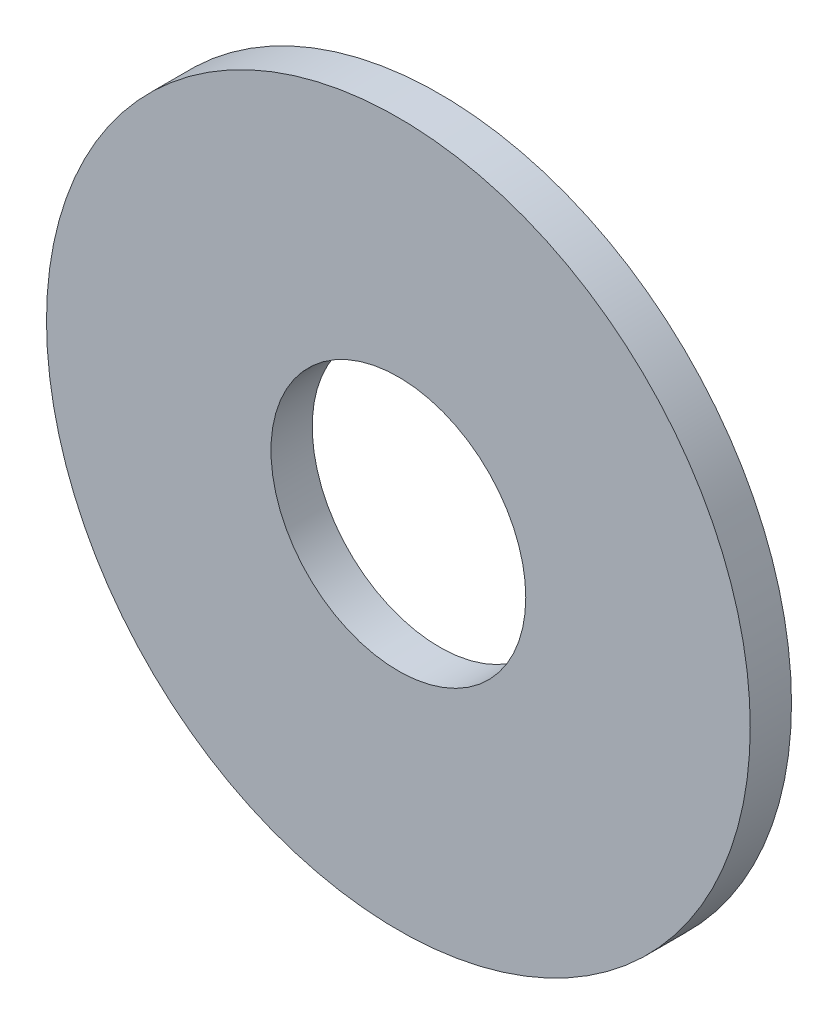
from build123d import *

# Parameters (mm, degrees)
ESQUISSE1_R      = 14.5
ESQUISSE1_R_2    = 5.25
EXTRUSION1_DEPTH = 1.7


with BuildPart() as part:
    # Esquisse1 → Extrusion1 (new body)
    with BuildSketch(Plane.XY):
        Circle(ESQUISSE1_R)
        Circle(ESQUISSE1_R_2, mode=Mode.SUBTRACT)
    extrude(amount=EXTRUSION1_DEPTH)


solid = part.part
